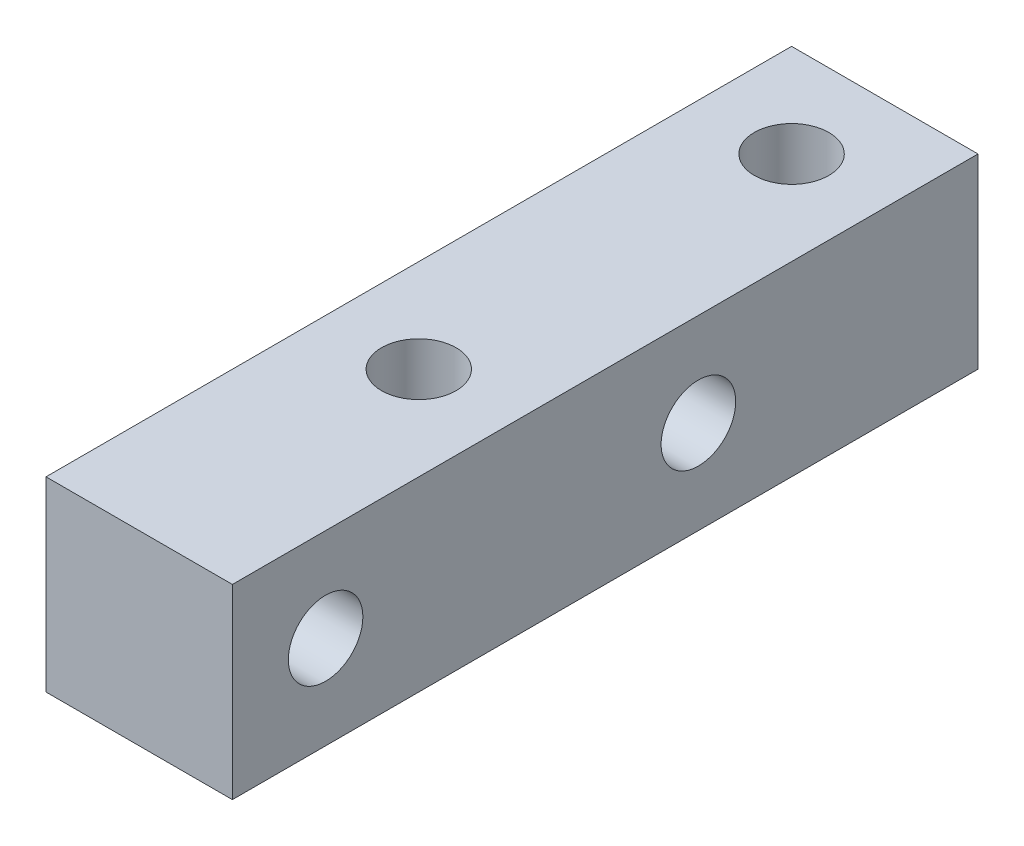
ISO-10303-21;
HEADER;
FILE_DESCRIPTION(('STEP AP214'),'2;1');
FILE_NAME('part.step','',(''),(''),'','','');
FILE_SCHEMA(('AUTOMOTIVE_DESIGN { 1 0 10303 214 1 1 1 1 }'));
ENDSEC;
DATA;
#1=APPLICATION_CONTEXT('core data for automotive mechanical design processes');
#2=APPLICATION_PROTOCOL_DEFINITION('international standard','automotive_design',2000,#1);
#3=PRODUCT_CONTEXT('',#1,'mechanical');
#4=PRODUCT('Part','Part','',(#3));
#5=PRODUCT_RELATED_PRODUCT_CATEGORY('part','',(#4));
#6=PRODUCT_DEFINITION_FORMATION('','',#4);
#7=PRODUCT_DEFINITION_CONTEXT('part definition',#1,'design');
#8=PRODUCT_DEFINITION('design','',#6,#7);
#9=PRODUCT_DEFINITION_SHAPE('','',#8);
#10=(LENGTH_UNIT() NAMED_UNIT(*) SI_UNIT(.MILLI.,.METRE.));
#11=(NAMED_UNIT(*) PLANE_ANGLE_UNIT() SI_UNIT($,.RADIAN.));
#12=(NAMED_UNIT(*) SI_UNIT($,.STERADIAN.) SOLID_ANGLE_UNIT());
#13=UNCERTAINTY_MEASURE_WITH_UNIT(LENGTH_MEASURE(1.E-05),#10,'distance_accuracy_value','');
#14=(GEOMETRIC_REPRESENTATION_CONTEXT(3) GLOBAL_UNCERTAINTY_ASSIGNED_CONTEXT((#13)) GLOBAL_UNIT_ASSIGNED_CONTEXT((#10,
#11,#12)) REPRESENTATION_CONTEXT('',''));
#15=CARTESIAN_POINT('',(0.,0.,0.));
#16=DIRECTION('',(0.,0.,1.));
#17=DIRECTION('',(1.,0.,0.));
#18=AXIS2_PLACEMENT_3D('',#15,#16,#17);
#19=CARTESIAN_POINT('',(0.,0.,0.));
#20=DIRECTION('',(0.,0.,1.));
#21=DIRECTION('',(1.,0.,0.));
#22=AXIS2_PLACEMENT_3D('',#19,#20,#21);
#23=PLANE('',#22);
#24=DIRECTION('',(0.,1.,0.));
#25=VECTOR('',#24,1.);
#26=CARTESIAN_POINT('',(5.,5.,0.));
#27=LINE('',#26,#25);
#28=CARTESIAN_POINT('',(5.,-5.,0.));
#29=VERTEX_POINT('',#28);
#30=CARTESIAN_POINT('',(5.,5.,0.));
#31=VERTEX_POINT('',#30);
#32=EDGE_CURVE('E83',#29,#31,#27,.T.);
#33=ORIENTED_EDGE('',*,*,#32,.F.);
#34=DIRECTION('',(1.,0.,0.));
#35=VECTOR('',#34,1.);
#36=CARTESIAN_POINT('',(-5.,-5.,0.));
#37=LINE('',#36,#35);
#38=CARTESIAN_POINT('',(-5.,-5.,0.));
#39=VERTEX_POINT('',#38);
#40=EDGE_CURVE('E26',#39,#29,#37,.T.);
#41=ORIENTED_EDGE('',*,*,#40,.F.);
#42=DIRECTION('',(0.,-1.,0.));
#43=VECTOR('',#42,1.);
#44=CARTESIAN_POINT('',(-5.,5.,0.));
#45=LINE('',#44,#43);
#46=CARTESIAN_POINT('',(-5.,5.,0.));
#47=VERTEX_POINT('',#46);
#48=EDGE_CURVE('E112',#47,#39,#45,.T.);
#49=ORIENTED_EDGE('',*,*,#48,.F.);
#50=DIRECTION('',(-1.,0.,0.));
#51=VECTOR('',#50,1.);
#52=CARTESIAN_POINT('',(-5.,5.,0.));
#53=LINE('',#52,#51);
#54=EDGE_CURVE('E87',#31,#47,#53,.T.);
#55=ORIENTED_EDGE('',*,*,#54,.F.);
#56=EDGE_LOOP('',(#33,#41,#49,#55));
#57=FACE_BOUND('',#56,.T.);
#58=ADVANCED_FACE('F17',(#57),#23,.F.);
#59=CARTESIAN_POINT('',(0.,0.,40.));
#60=DIRECTION('',(0.,0.,1.));
#61=DIRECTION('',(1.,0.,0.));
#62=AXIS2_PLACEMENT_3D('',#59,#60,#61);
#63=PLANE('',#62);
#64=DIRECTION('',(0.,1.,0.));
#65=VECTOR('',#64,1.);
#66=CARTESIAN_POINT('',(5.,5.,40.));
#67=LINE('',#66,#65);
#68=CARTESIAN_POINT('',(5.,-5.,40.));
#69=VERTEX_POINT('',#68);
#70=CARTESIAN_POINT('',(5.,5.,40.));
#71=VERTEX_POINT('',#70);
#72=EDGE_CURVE('E85',#69,#71,#67,.T.);
#73=ORIENTED_EDGE('',*,*,#72,.T.);
#74=DIRECTION('',(-1.,0.,0.));
#75=VECTOR('',#74,1.);
#76=CARTESIAN_POINT('',(-5.,5.,40.));
#77=LINE('',#76,#75);
#78=CARTESIAN_POINT('',(-5.,5.,40.));
#79=VERTEX_POINT('',#78);
#80=EDGE_CURVE('E108',#71,#79,#77,.T.);
#81=ORIENTED_EDGE('',*,*,#80,.T.);
#82=DIRECTION('',(0.,-1.,0.));
#83=VECTOR('',#82,1.);
#84=CARTESIAN_POINT('',(-5.,5.,40.));
#85=LINE('',#84,#83);
#86=CARTESIAN_POINT('',(-5.,-5.,40.));
#87=VERTEX_POINT('',#86);
#88=EDGE_CURVE('E78',#79,#87,#85,.T.);
#89=ORIENTED_EDGE('',*,*,#88,.T.);
#90=DIRECTION('',(1.,0.,0.));
#91=VECTOR('',#90,1.);
#92=CARTESIAN_POINT('',(-5.,-5.,40.));
#93=LINE('',#92,#91);
#94=EDGE_CURVE('E11',#87,#69,#93,.T.);
#95=ORIENTED_EDGE('',*,*,#94,.T.);
#96=EDGE_LOOP('',(#73,#81,#89,#95));
#97=FACE_BOUND('',#96,.T.);
#98=ADVANCED_FACE('F19',(#97),#63,.T.);
#99=CARTESIAN_POINT('',(-5.,-5.,40.));
#100=DIRECTION('',(0.,1.,0.));
#101=DIRECTION('',(1.,0.,0.));
#102=AXIS2_PLACEMENT_3D('',#99,#100,#101);
#103=PLANE('',#102);
#104=CARTESIAN_POINT('',(0.,-5.,25.));
#105=DIRECTION('',(0.,1.,0.));
#106=DIRECTION('',(0.,0.,1.));
#107=AXIS2_PLACEMENT_3D('',#104,#105,#106);
#108=CIRCLE('',#107,2.);
#109=CARTESIAN_POINT('',(0.,-5.,27.));
#110=VERTEX_POINT('',#109);
#111=EDGE_CURVE('E103',#110,#110,#108,.T.);
#112=ORIENTED_EDGE('',*,*,#111,.T.);
#113=EDGE_LOOP('',(#112));
#114=FACE_BOUND('',#113,.T.);
#115=CARTESIAN_POINT('',(0.,-5.,5.));
#116=DIRECTION('',(0.,1.,0.));
#117=DIRECTION('',(0.,0.,1.));
#118=AXIS2_PLACEMENT_3D('',#115,#116,#117);
#119=CIRCLE('',#118,2.);
#120=CARTESIAN_POINT('',(0.,-5.,7.));
#121=VERTEX_POINT('',#120);
#122=EDGE_CURVE('E137',#121,#121,#119,.T.);
#123=ORIENTED_EDGE('',*,*,#122,.T.);
#124=EDGE_LOOP('',(#123));
#125=FACE_BOUND('',#124,.T.);
#126=ORIENTED_EDGE('',*,*,#40,.T.);
#127=DIRECTION('',(0.,0.,-1.));
#128=VECTOR('',#127,1.);
#129=CARTESIAN_POINT('',(5.,-5.,40.));
#130=LINE('',#129,#128);
#131=EDGE_CURVE('E72',#69,#29,#130,.T.);
#132=ORIENTED_EDGE('',*,*,#131,.F.);
#133=ORIENTED_EDGE('',*,*,#94,.F.);
#134=DIRECTION('',(0.,0.,-1.));
#135=VECTOR('',#134,1.);
#136=CARTESIAN_POINT('',(-5.,-5.,40.));
#137=LINE('',#136,#135);
#138=EDGE_CURVE('E75',#87,#39,#137,.T.);
#139=ORIENTED_EDGE('',*,*,#138,.T.);
#140=EDGE_LOOP('',(#126,#132,#133,#139));
#141=FACE_BOUND('',#140,.T.);
#142=ADVANCED_FACE('F71',(#114,#125,#141),#103,.F.);
#143=CARTESIAN_POINT('',(-5.,5.,40.));
#144=DIRECTION('',(1.,0.,0.));
#145=DIRECTION('',(0.,1.,0.));
#146=AXIS2_PLACEMENT_3D('',#143,#144,#145);
#147=PLANE('',#146);
#148=CARTESIAN_POINT('',(-5.,0.,15.));
#149=DIRECTION('',(1.,0.,0.));
#150=DIRECTION('',(0.,0.,-1.));
#151=AXIS2_PLACEMENT_3D('',#148,#149,#150);
#152=CIRCLE('',#151,2.);
#153=CARTESIAN_POINT('',(-5.,0.,13.));
#154=VERTEX_POINT('',#153);
#155=EDGE_CURVE('E138',#154,#154,#152,.T.);
#156=ORIENTED_EDGE('',*,*,#155,.T.);
#157=EDGE_LOOP('',(#156));
#158=FACE_BOUND('',#157,.T.);
#159=CARTESIAN_POINT('',(-5.,0.,35.));
#160=DIRECTION('',(1.,0.,0.));
#161=DIRECTION('',(0.,0.,-1.));
#162=AXIS2_PLACEMENT_3D('',#159,#160,#161);
#163=CIRCLE('',#162,2.);
#164=CARTESIAN_POINT('',(-5.,0.,33.));
#165=VERTEX_POINT('',#164);
#166=EDGE_CURVE('E155',#165,#165,#163,.T.);
#167=ORIENTED_EDGE('',*,*,#166,.T.);
#168=EDGE_LOOP('',(#167));
#169=FACE_BOUND('',#168,.T.);
#170=ORIENTED_EDGE('',*,*,#48,.T.);
#171=ORIENTED_EDGE('',*,*,#138,.F.);
#172=ORIENTED_EDGE('',*,*,#88,.F.);
#173=DIRECTION('',(0.,0.,-1.));
#174=VECTOR('',#173,1.);
#175=CARTESIAN_POINT('',(-5.,5.,40.));
#176=LINE('',#175,#174);
#177=EDGE_CURVE('E113',#79,#47,#176,.T.);
#178=ORIENTED_EDGE('',*,*,#177,.T.);
#179=EDGE_LOOP('',(#170,#171,#172,#178));
#180=FACE_BOUND('',#179,.T.);
#181=ADVANCED_FACE('F164',(#158,#169,#180),#147,.F.);
#182=CARTESIAN_POINT('',(-5.,5.,40.));
#183=DIRECTION('',(0.,-1.,0.));
#184=DIRECTION('',(0.,0.,-1.));
#185=AXIS2_PLACEMENT_3D('',#182,#183,#184);
#186=PLANE('',#185);
#187=CARTESIAN_POINT('',(0.,5.,25.));
#188=DIRECTION('',(0.,1.,0.));
#189=DIRECTION('',(0.,0.,1.));
#190=AXIS2_PLACEMENT_3D('',#187,#188,#189);
#191=CIRCLE('',#190,2.);
#192=CARTESIAN_POINT('',(0.,5.,27.));
#193=VERTEX_POINT('',#192);
#194=EDGE_CURVE('E93',#193,#193,#191,.T.);
#195=ORIENTED_EDGE('',*,*,#194,.F.);
#196=EDGE_LOOP('',(#195));
#197=FACE_BOUND('',#196,.T.);
#198=CARTESIAN_POINT('',(0.,5.,5.));
#199=DIRECTION('',(0.,1.,0.));
#200=DIRECTION('',(0.,0.,1.));
#201=AXIS2_PLACEMENT_3D('',#198,#199,#200);
#202=CIRCLE('',#201,2.);
#203=CARTESIAN_POINT('',(0.,5.,7.));
#204=VERTEX_POINT('',#203);
#205=EDGE_CURVE('E106',#204,#204,#202,.T.);
#206=ORIENTED_EDGE('',*,*,#205,.F.);
#207=EDGE_LOOP('',(#206));
#208=FACE_BOUND('',#207,.T.);
#209=ORIENTED_EDGE('',*,*,#54,.T.);
#210=ORIENTED_EDGE('',*,*,#177,.F.);
#211=ORIENTED_EDGE('',*,*,#80,.F.);
#212=DIRECTION('',(0.,0.,-1.));
#213=VECTOR('',#212,1.);
#214=CARTESIAN_POINT('',(5.,5.,40.));
#215=LINE('',#214,#213);
#216=EDGE_CURVE('E92',#71,#31,#215,.T.);
#217=ORIENTED_EDGE('',*,*,#216,.T.);
#218=EDGE_LOOP('',(#209,#210,#211,#217));
#219=FACE_BOUND('',#218,.T.);
#220=ADVANCED_FACE('F186',(#197,#208,#219),#186,.F.);
#221=CARTESIAN_POINT('',(5.,5.,40.));
#222=DIRECTION('',(-1.,0.,0.));
#223=DIRECTION('',(0.,0.,1.));
#224=AXIS2_PLACEMENT_3D('',#221,#222,#223);
#225=PLANE('',#224);
#226=CARTESIAN_POINT('',(5.,0.,15.));
#227=DIRECTION('',(1.,0.,0.));
#228=DIRECTION('',(0.,0.,-1.));
#229=AXIS2_PLACEMENT_3D('',#226,#227,#228);
#230=CIRCLE('',#229,2.);
#231=CARTESIAN_POINT('',(5.,0.,13.));
#232=VERTEX_POINT('',#231);
#233=EDGE_CURVE('E134',#232,#232,#230,.T.);
#234=ORIENTED_EDGE('',*,*,#233,.F.);
#235=EDGE_LOOP('',(#234));
#236=FACE_BOUND('',#235,.T.);
#237=CARTESIAN_POINT('',(5.,0.,35.));
#238=DIRECTION('',(1.,0.,0.));
#239=DIRECTION('',(0.,0.,-1.));
#240=AXIS2_PLACEMENT_3D('',#237,#238,#239);
#241=CIRCLE('',#240,2.);
#242=CARTESIAN_POINT('',(5.,0.,33.));
#243=VERTEX_POINT('',#242);
#244=EDGE_CURVE('E147',#243,#243,#241,.T.);
#245=ORIENTED_EDGE('',*,*,#244,.F.);
#246=EDGE_LOOP('',(#245));
#247=FACE_BOUND('',#246,.T.);
#248=ORIENTED_EDGE('',*,*,#32,.T.);
#249=ORIENTED_EDGE('',*,*,#216,.F.);
#250=ORIENTED_EDGE('',*,*,#72,.F.);
#251=ORIENTED_EDGE('',*,*,#131,.T.);
#252=EDGE_LOOP('',(#248,#249,#250,#251));
#253=FACE_BOUND('',#252,.T.);
#254=ADVANCED_FACE('F81',(#236,#247,#253),#225,.F.);
#255=CARTESIAN_POINT('',(0.,-35.,25.));
#256=DIRECTION('',(0.,1.,0.));
#257=DIRECTION('',(0.,0.,1.));
#258=AXIS2_PLACEMENT_3D('',#255,#256,#257);
#259=CYLINDRICAL_SURFACE('',#258,2.);
#260=ORIENTED_EDGE('',*,*,#194,.T.);
#261=EDGE_LOOP('',(#260));
#262=FACE_BOUND('',#261,.T.);
#263=ORIENTED_EDGE('',*,*,#111,.F.);
#264=EDGE_LOOP('',(#263));
#265=FACE_BOUND('',#264,.T.);
#266=ADVANCED_FACE('F201',(#262,#265),#259,.F.);
#267=CARTESIAN_POINT('',(0.,-35.,5.));
#268=DIRECTION('',(0.,1.,0.));
#269=DIRECTION('',(0.,0.,1.));
#270=AXIS2_PLACEMENT_3D('',#267,#268,#269);
#271=CYLINDRICAL_SURFACE('',#270,2.);
#272=ORIENTED_EDGE('',*,*,#205,.T.);
#273=EDGE_LOOP('',(#272));
#274=FACE_BOUND('',#273,.T.);
#275=ORIENTED_EDGE('',*,*,#122,.F.);
#276=EDGE_LOOP('',(#275));
#277=FACE_BOUND('',#276,.T.);
#278=ADVANCED_FACE('F176',(#274,#277),#271,.F.);
#279=CARTESIAN_POINT('',(-35.,0.,15.));
#280=DIRECTION('',(1.,0.,0.));
#281=DIRECTION('',(0.,0.,-1.));
#282=AXIS2_PLACEMENT_3D('',#279,#280,#281);
#283=CYLINDRICAL_SURFACE('',#282,2.);
#284=ORIENTED_EDGE('',*,*,#233,.T.);
#285=EDGE_LOOP('',(#284));
#286=FACE_BOUND('',#285,.T.);
#287=ORIENTED_EDGE('',*,*,#155,.F.);
#288=EDGE_LOOP('',(#287));
#289=FACE_BOUND('',#288,.T.);
#290=ADVANCED_FACE('F169',(#286,#289),#283,.F.);
#291=CARTESIAN_POINT('',(-35.,0.,35.));
#292=DIRECTION('',(1.,0.,0.));
#293=DIRECTION('',(0.,0.,-1.));
#294=AXIS2_PLACEMENT_3D('',#291,#292,#293);
#295=CYLINDRICAL_SURFACE('',#294,2.);
#296=ORIENTED_EDGE('',*,*,#244,.T.);
#297=EDGE_LOOP('',(#296));
#298=FACE_BOUND('',#297,.T.);
#299=ORIENTED_EDGE('',*,*,#166,.F.);
#300=EDGE_LOOP('',(#299));
#301=FACE_BOUND('',#300,.T.);
#302=ADVANCED_FACE('F167',(#298,#301),#295,.F.);
#303=CLOSED_SHELL('',(#58,#98,#142,#181,#220,#254,#266,#278,#290,#302));
#304=MANIFOLD_SOLID_BREP('B1',#303);
#305=ADVANCED_BREP_SHAPE_REPRESENTATION('',(#18,#304),#14);
#306=SHAPE_DEFINITION_REPRESENTATION(#9,#305);
ENDSEC;
END-ISO-10303-21;
